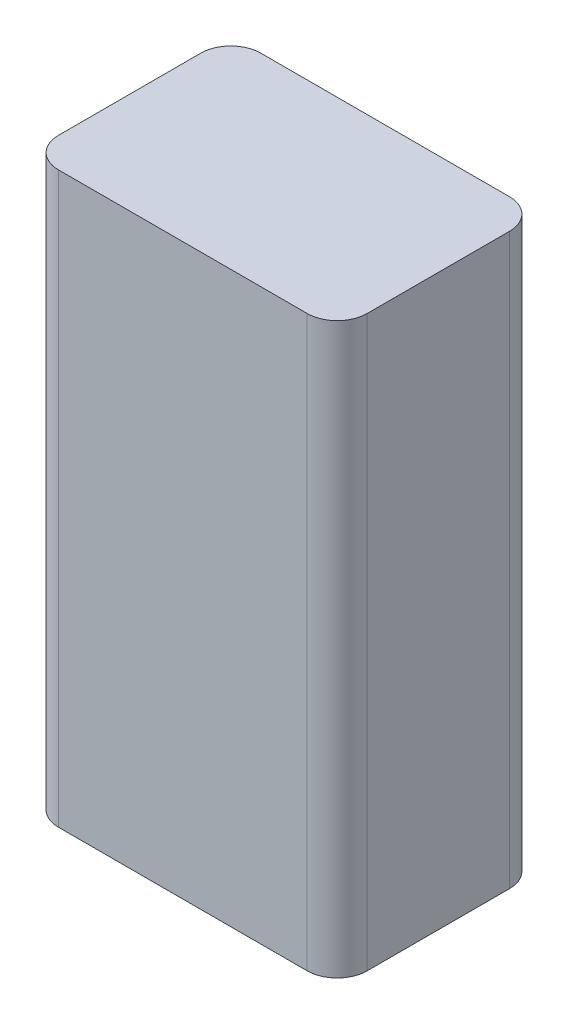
from build123d import *

# Parameters (mm, degrees)
SKETCH1_W           = 26.162
SKETCH1_H           = 48.26
BOSS_EXTRUDE1_DEPTH = 8.5725
FILLET1_R           = 2.54


with BuildPart() as part:
    # Sketch1 → Boss-Extrude1 (new, symmetric)
    with BuildSketch(Plane.XY):
        Rectangle(SKETCH1_W, SKETCH1_H)
    extrude(amount=BOSS_EXTRUDE1_DEPTH, both=True)

    # Fillet1
    fillet1_edges = [part.edges().sort_by_distance(p)[0] for p in [
        (-13.081, 0, 8.5725),
        (13.081, 0, 8.5725),
        (-13.081, 0, -8.5725),
        (13.081, 0, -8.5725),
    ]]
    fillet(fillet1_edges, radius=FILLET1_R)


solid = part.part
